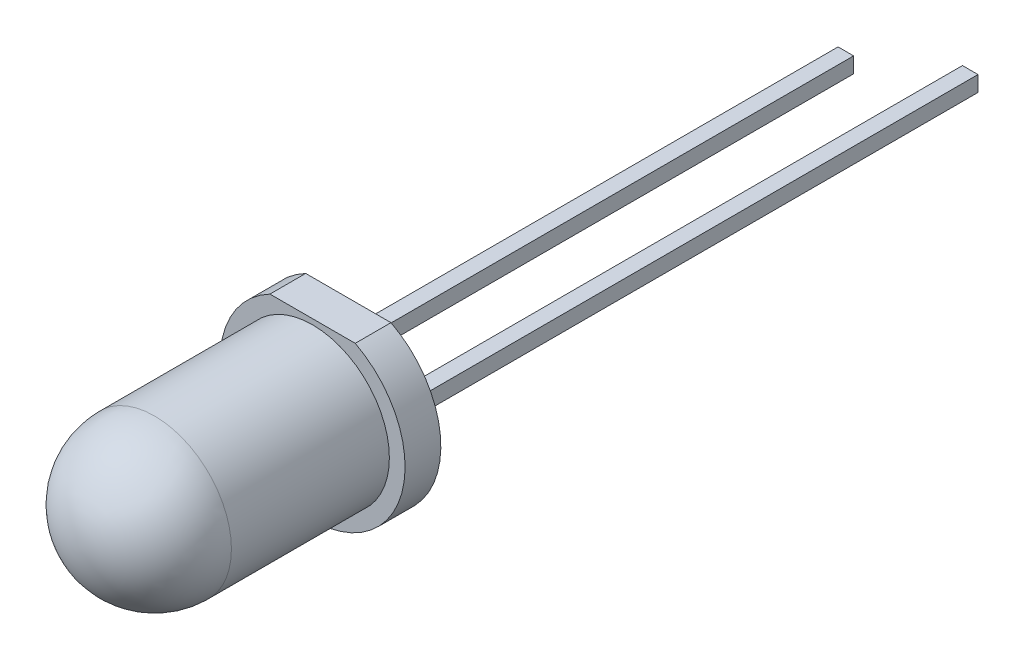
ISO-10303-21;
HEADER;
FILE_DESCRIPTION(('STEP AP214'),'2;1');
FILE_NAME('part.step','',(''),(''),'','','');
FILE_SCHEMA(('AUTOMOTIVE_DESIGN { 1 0 10303 214 1 1 1 1 }'));
ENDSEC;
DATA;
#1=APPLICATION_CONTEXT('core data for automotive mechanical design processes');
#2=APPLICATION_PROTOCOL_DEFINITION('international standard','automotive_design',2000,#1);
#3=PRODUCT_CONTEXT('',#1,'mechanical');
#4=PRODUCT('Part','Part','',(#3));
#5=PRODUCT_RELATED_PRODUCT_CATEGORY('part','',(#4));
#6=PRODUCT_DEFINITION_FORMATION('','',#4);
#7=PRODUCT_DEFINITION_CONTEXT('part definition',#1,'design');
#8=PRODUCT_DEFINITION('design','',#6,#7);
#9=PRODUCT_DEFINITION_SHAPE('','',#8);
#10=(LENGTH_UNIT() NAMED_UNIT(*) SI_UNIT(.MILLI.,.METRE.));
#11=(NAMED_UNIT(*) PLANE_ANGLE_UNIT() SI_UNIT($,.RADIAN.));
#12=(NAMED_UNIT(*) SI_UNIT($,.STERADIAN.) SOLID_ANGLE_UNIT());
#13=UNCERTAINTY_MEASURE_WITH_UNIT(LENGTH_MEASURE(1.E-05),#10,'distance_accuracy_value','');
#14=(GEOMETRIC_REPRESENTATION_CONTEXT(3) GLOBAL_UNCERTAINTY_ASSIGNED_CONTEXT((#13)) GLOBAL_UNIT_ASSIGNED_CONTEXT((#10,
#11,#12)) REPRESENTATION_CONTEXT('',''));
#15=CARTESIAN_POINT('',(0.,0.,0.));
#16=DIRECTION('',(0.,0.,1.));
#17=DIRECTION('',(1.,0.,0.));
#18=AXIS2_PLACEMENT_3D('',#15,#16,#17);
#19=CARTESIAN_POINT('',(0.25,1.51,-20.575));
#20=DIRECTION('',(-1.,0.,0.));
#21=DIRECTION('',(0.,-1.,0.));
#22=AXIS2_PLACEMENT_3D('',#19,#20,#21);
#23=PLANE('',#22);
#24=DIRECTION('',(0.,-1.,0.));
#25=VECTOR('',#24,1.);
#26=CARTESIAN_POINT('',(0.25,1.51,-16.575));
#27=LINE('',#26,#25);
#28=CARTESIAN_POINT('',(0.25,1.51,-16.575));
#29=VERTEX_POINT('',#28);
#30=CARTESIAN_POINT('',(0.25,1.01,-16.575));
#31=VERTEX_POINT('',#30);
#32=EDGE_CURVE('E105',#29,#31,#27,.T.);
#33=ORIENTED_EDGE('',*,*,#32,.F.);
#34=DIRECTION('',(0.,0.,1.));
#35=VECTOR('',#34,1.);
#36=CARTESIAN_POINT('',(0.25,1.51,-20.575));
#37=LINE('',#36,#35);
#38=CARTESIAN_POINT('',(0.25,1.51,-0.575));
#39=VERTEX_POINT('',#38);
#40=EDGE_CURVE('E233',#29,#39,#37,.T.);
#41=ORIENTED_EDGE('',*,*,#40,.T.);
#42=DIRECTION('',(0.,-1.,0.));
#43=VECTOR('',#42,1.);
#44=CARTESIAN_POINT('',(0.25,1.51,-0.575));
#45=LINE('',#44,#43);
#46=CARTESIAN_POINT('',(0.25,1.01,-0.575));
#47=VERTEX_POINT('',#46);
#48=EDGE_CURVE('E124',#39,#47,#45,.T.);
#49=ORIENTED_EDGE('',*,*,#48,.T.);
#50=DIRECTION('',(0.,0.,1.));
#51=VECTOR('',#50,1.);
#52=CARTESIAN_POINT('',(0.25,1.01,-20.575));
#53=LINE('',#52,#51);
#54=EDGE_CURVE('E118',#31,#47,#53,.T.);
#55=ORIENTED_EDGE('',*,*,#54,.F.);
#56=EDGE_LOOP('',(#33,#41,#49,#55));
#57=FACE_BOUND('',#56,.T.);
#58=ADVANCED_FACE('F31',(#57),#23,.F.);
#59=CARTESIAN_POINT('',(0.25,1.01,-20.575));
#60=DIRECTION('',(0.,1.,0.));
#61=DIRECTION('',(0.,0.,1.));
#62=AXIS2_PLACEMENT_3D('',#59,#60,#61);
#63=PLANE('',#62);
#64=DIRECTION('',(-1.,0.,0.));
#65=VECTOR('',#64,1.);
#66=CARTESIAN_POINT('',(0.25,1.01,-16.575));
#67=LINE('',#66,#65);
#68=CARTESIAN_POINT('',(-0.25,1.01,-16.575));
#69=VERTEX_POINT('',#68);
#70=EDGE_CURVE('E108',#31,#69,#67,.T.);
#71=ORIENTED_EDGE('',*,*,#70,.F.);
#72=ORIENTED_EDGE('',*,*,#54,.T.);
#73=DIRECTION('',(-1.,0.,0.));
#74=VECTOR('',#73,1.);
#75=CARTESIAN_POINT('',(0.25,1.01,-0.575));
#76=LINE('',#75,#74);
#77=CARTESIAN_POINT('',(-0.25,1.01,-0.575));
#78=VERTEX_POINT('',#77);
#79=EDGE_CURVE('E225',#47,#78,#76,.T.);
#80=ORIENTED_EDGE('',*,*,#79,.T.);
#81=DIRECTION('',(0.,0.,1.));
#82=VECTOR('',#81,1.);
#83=CARTESIAN_POINT('',(-0.25,1.01,-20.575));
#84=LINE('',#83,#82);
#85=EDGE_CURVE('E120',#69,#78,#84,.T.);
#86=ORIENTED_EDGE('',*,*,#85,.F.);
#87=EDGE_LOOP('',(#71,#72,#80,#86));
#88=FACE_BOUND('',#87,.T.);
#89=ADVANCED_FACE('F116',(#88),#63,.F.);
#90=CARTESIAN_POINT('',(-0.25,1.51,-20.575));
#91=DIRECTION('',(1.,0.,0.));
#92=DIRECTION('',(0.,1.,0.));
#93=AXIS2_PLACEMENT_3D('',#90,#91,#92);
#94=PLANE('',#93);
#95=DIRECTION('',(0.,1.,0.));
#96=VECTOR('',#95,1.);
#97=CARTESIAN_POINT('',(-0.25,1.51,-16.575));
#98=LINE('',#97,#96);
#99=CARTESIAN_POINT('',(-0.25,1.51,-16.575));
#100=VERTEX_POINT('',#99);
#101=EDGE_CURVE('E46',#69,#100,#98,.T.);
#102=ORIENTED_EDGE('',*,*,#101,.F.);
#103=ORIENTED_EDGE('',*,*,#85,.T.);
#104=DIRECTION('',(0.,1.,0.));
#105=VECTOR('',#104,1.);
#106=CARTESIAN_POINT('',(-0.25,1.51,-0.575));
#107=LINE('',#106,#105);
#108=CARTESIAN_POINT('',(-0.25,1.51,-0.575));
#109=VERTEX_POINT('',#108);
#110=EDGE_CURVE('E227',#78,#109,#107,.T.);
#111=ORIENTED_EDGE('',*,*,#110,.T.);
#112=DIRECTION('',(0.,0.,1.));
#113=VECTOR('',#112,1.);
#114=CARTESIAN_POINT('',(-0.25,1.51,-20.575));
#115=LINE('',#114,#113);
#116=EDGE_CURVE('E129',#100,#109,#115,.T.);
#117=ORIENTED_EDGE('',*,*,#116,.F.);
#118=EDGE_LOOP('',(#102,#103,#111,#117));
#119=FACE_BOUND('',#118,.T.);
#120=ADVANCED_FACE('F167',(#119),#94,.F.);
#121=CARTESIAN_POINT('',(0.25,1.51,-20.575));
#122=DIRECTION('',(0.,-1.,0.));
#123=DIRECTION('',(0.,0.,-1.));
#124=AXIS2_PLACEMENT_3D('',#121,#122,#123);
#125=PLANE('',#124);
#126=DIRECTION('',(1.,0.,0.));
#127=VECTOR('',#126,1.);
#128=CARTESIAN_POINT('',(0.25,1.51,-16.575));
#129=LINE('',#128,#127);
#130=EDGE_CURVE('E109',#100,#29,#129,.T.);
#131=ORIENTED_EDGE('',*,*,#130,.F.);
#132=ORIENTED_EDGE('',*,*,#116,.T.);
#133=DIRECTION('',(1.,0.,0.));
#134=VECTOR('',#133,1.);
#135=CARTESIAN_POINT('',(0.25,1.51,-0.575));
#136=LINE('',#135,#134);
#137=EDGE_CURVE('E230',#109,#39,#136,.T.);
#138=ORIENTED_EDGE('',*,*,#137,.T.);
#139=ORIENTED_EDGE('',*,*,#40,.F.);
#140=EDGE_LOOP('',(#131,#132,#138,#139));
#141=FACE_BOUND('',#140,.T.);
#142=ADVANCED_FACE('F177',(#141),#125,.F.);
#143=CARTESIAN_POINT('',(0.,0.,-0.575));
#144=DIRECTION('',(0.,0.,1.));
#145=DIRECTION('',(1.,0.,0.));
#146=AXIS2_PLACEMENT_3D('',#143,#144,#145);
#147=PLANE('',#146);
#148=ORIENTED_EDGE('',*,*,#48,.F.);
#149=ORIENTED_EDGE('',*,*,#137,.F.);
#150=ORIENTED_EDGE('',*,*,#110,.F.);
#151=ORIENTED_EDGE('',*,*,#79,.F.);
#152=EDGE_LOOP('',(#148,#149,#150,#151));
#153=FACE_BOUND('',#152,.T.);
#154=DIRECTION('',(-1.,0.,0.));
#155=VECTOR('',#154,1.);
#156=CARTESIAN_POINT('',(0.,2.64,-0.575));
#157=LINE('',#156,#155);
#158=CARTESIAN_POINT('',(1.37150464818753,2.64,-0.575));
#159=VERTEX_POINT('',#158);
#160=CARTESIAN_POINT('',(-1.37150464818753,2.64,-0.575));
#161=VERTEX_POINT('',#160);
#162=EDGE_CURVE('E11',#159,#161,#157,.T.);
#163=ORIENTED_EDGE('',*,*,#162,.F.);
#164=CARTESIAN_POINT('',(0.,0.,-0.575));
#165=DIRECTION('',(0.,0.,1.));
#166=DIRECTION('',(1.,0.,0.));
#167=AXIS2_PLACEMENT_3D('',#164,#165,#166);
#168=CIRCLE('',#167,2.975);
#169=EDGE_CURVE('E140',#161,#159,#168,.T.);
#170=ORIENTED_EDGE('',*,*,#169,.F.);
#171=EDGE_LOOP('',(#163,#170));
#172=FACE_BOUND('',#171,.T.);
#173=DIRECTION('',(0.,-1.,0.));
#174=VECTOR('',#173,1.);
#175=CARTESIAN_POINT('',(0.25,-1.01,-0.575));
#176=LINE('',#175,#174);
#177=CARTESIAN_POINT('',(0.25,-1.01,-0.575));
#178=VERTEX_POINT('',#177);
#179=CARTESIAN_POINT('',(0.25,-1.51,-0.575));
#180=VERTEX_POINT('',#179);
#181=EDGE_CURVE('E191',#178,#180,#176,.T.);
#182=ORIENTED_EDGE('',*,*,#181,.F.);
#183=DIRECTION('',(1.,0.,0.));
#184=VECTOR('',#183,1.);
#185=CARTESIAN_POINT('',(0.25,-1.01,-0.575));
#186=LINE('',#185,#184);
#187=CARTESIAN_POINT('',(-0.25,-1.01,-0.575));
#188=VERTEX_POINT('',#187);
#189=EDGE_CURVE('E193',#188,#178,#186,.T.);
#190=ORIENTED_EDGE('',*,*,#189,.F.);
#191=DIRECTION('',(0.,1.,0.));
#192=VECTOR('',#191,1.);
#193=CARTESIAN_POINT('',(-0.25,-1.01,-0.575));
#194=LINE('',#193,#192);
#195=CARTESIAN_POINT('',(-0.25,-1.51,-0.575));
#196=VERTEX_POINT('',#195);
#197=EDGE_CURVE('E209',#196,#188,#194,.T.);
#198=ORIENTED_EDGE('',*,*,#197,.F.);
#199=DIRECTION('',(-1.,0.,0.));
#200=VECTOR('',#199,1.);
#201=CARTESIAN_POINT('',(0.25,-1.51,-0.575));
#202=LINE('',#201,#200);
#203=EDGE_CURVE('E54',#180,#196,#202,.T.);
#204=ORIENTED_EDGE('',*,*,#203,.F.);
#205=EDGE_LOOP('',(#182,#190,#198,#204));
#206=FACE_BOUND('',#205,.T.);
#207=ADVANCED_FACE('F174',(#153,#172,#206),#147,.F.);
#208=CARTESIAN_POINT('',(0.,0.,0.575));
#209=DIRECTION('',(0.,0.,1.));
#210=DIRECTION('',(1.,0.,0.));
#211=AXIS2_PLACEMENT_3D('',#208,#209,#210);
#212=PLANE('',#211);
#213=CARTESIAN_POINT('',(0.,0.,0.575));
#214=DIRECTION('',(0.,0.,1.));
#215=DIRECTION('',(1.,0.,0.));
#216=AXIS2_PLACEMENT_3D('',#213,#214,#215);
#217=CIRCLE('',#216,2.47);
#218=CARTESIAN_POINT('',(2.47,0.,0.575));
#219=VERTEX_POINT('',#218);
#220=EDGE_CURVE('E137',#219,#219,#217,.T.);
#221=ORIENTED_EDGE('',*,*,#220,.F.);
#222=EDGE_LOOP('',(#221));
#223=FACE_BOUND('',#222,.T.);
#224=CARTESIAN_POINT('',(0.,0.,0.575));
#225=DIRECTION('',(0.,0.,1.));
#226=DIRECTION('',(1.,0.,0.));
#227=AXIS2_PLACEMENT_3D('',#224,#225,#226);
#228=CIRCLE('',#227,2.975);
#229=CARTESIAN_POINT('',(-1.37150464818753,2.64,0.575));
#230=VERTEX_POINT('',#229);
#231=CARTESIAN_POINT('',(1.37150464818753,2.64,0.575));
#232=VERTEX_POINT('',#231);
#233=EDGE_CURVE('E141',#230,#232,#228,.T.);
#234=ORIENTED_EDGE('',*,*,#233,.T.);
#235=DIRECTION('',(-1.,0.,0.));
#236=VECTOR('',#235,1.);
#237=CARTESIAN_POINT('',(0.,2.64,0.575));
#238=LINE('',#237,#236);
#239=EDGE_CURVE('E134',#232,#230,#238,.T.);
#240=ORIENTED_EDGE('',*,*,#239,.T.);
#241=EDGE_LOOP('',(#234,#240));
#242=FACE_BOUND('',#241,.T.);
#243=ADVANCED_FACE('F171',(#223,#242),#212,.T.);
#244=CARTESIAN_POINT('',(0.,0.,0.575));
#245=DIRECTION('',(0.,0.,-1.));
#246=DIRECTION('',(-1.,0.,0.));
#247=AXIS2_PLACEMENT_3D('',#244,#245,#246);
#248=CYLINDRICAL_SURFACE('',#247,2.975);
#249=DIRECTION('',(0.,0.,-1.));
#250=VECTOR('',#249,1.);
#251=CARTESIAN_POINT('',(1.37150464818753,2.64,0.575));
#252=LINE('',#251,#250);
#253=EDGE_CURVE('E127',#232,#159,#252,.T.);
#254=ORIENTED_EDGE('',*,*,#253,.F.);
#255=ORIENTED_EDGE('',*,*,#233,.F.);
#256=DIRECTION('',(0.,0.,-1.));
#257=VECTOR('',#256,1.);
#258=CARTESIAN_POINT('',(-1.37150464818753,2.64,0.575));
#259=LINE('',#258,#257);
#260=EDGE_CURVE('E125',#161,#230,#259,.F.);
#261=ORIENTED_EDGE('',*,*,#260,.F.);
#262=ORIENTED_EDGE('',*,*,#169,.T.);
#263=EDGE_LOOP('',(#254,#255,#261,#262));
#264=FACE_BOUND('',#263,.T.);
#265=ADVANCED_FACE('F160',(#264),#248,.T.);
#266=CARTESIAN_POINT('',(0.,0.,8.125));
#267=DIRECTION('',(0.,0.,-1.));
#268=DIRECTION('',(-1.,0.,0.));
#269=AXIS2_PLACEMENT_3D('',#266,#267,#268);
#270=CYLINDRICAL_SURFACE('',#269,2.47);
#271=CARTESIAN_POINT('',(0.,0.,5.655));
#272=DIRECTION('',(0.,0.,-1.));
#273=DIRECTION('',(-1.,0.,0.));
#274=AXIS2_PLACEMENT_3D('',#271,#272,#273);
#275=CIRCLE('',#274,2.47);
#276=CARTESIAN_POINT('',(-2.47,0.,5.655));
#277=VERTEX_POINT('',#276);
#278=EDGE_CURVE('E39',#277,#277,#275,.T.);
#279=ORIENTED_EDGE('',*,*,#278,.T.);
#280=EDGE_LOOP('',(#279));
#281=FACE_BOUND('',#280,.T.);
#282=ORIENTED_EDGE('',*,*,#220,.T.);
#283=EDGE_LOOP('',(#282));
#284=FACE_BOUND('',#283,.T.);
#285=ADVANCED_FACE('F148',(#281,#284),#270,.T.);
#286=CARTESIAN_POINT('',(0.,0.,5.655));
#287=DIRECTION('',(0.,0.,1.));
#288=DIRECTION('',(1.,0.,0.));
#289=AXIS2_PLACEMENT_3D('',#286,#287,#288);
#290=SPHERICAL_SURFACE('',#289,2.47);
#291=ORIENTED_EDGE('',*,*,#278,.F.);
#292=EDGE_LOOP('',(#291));
#293=FACE_BOUND('',#292,.T.);
#294=ADVANCED_FACE('F33',(#293),#290,.T.);
#295=CARTESIAN_POINT('',(-4.59893373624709,2.64,3.07803442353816));
#296=DIRECTION('',(0.,1.,0.));
#297=DIRECTION('',(0.,0.,1.));
#298=AXIS2_PLACEMENT_3D('',#295,#296,#297);
#299=PLANE('',#298);
#300=ORIENTED_EDGE('',*,*,#253,.T.);
#301=ORIENTED_EDGE('',*,*,#162,.T.);
#302=ORIENTED_EDGE('',*,*,#260,.T.);
#303=ORIENTED_EDGE('',*,*,#239,.F.);
#304=EDGE_LOOP('',(#300,#301,#302,#303));
#305=FACE_BOUND('',#304,.T.);
#306=ADVANCED_FACE('F152',(#305),#299,.T.);
#307=CARTESIAN_POINT('',(0.25,-1.01,-20.575));
#308=DIRECTION('',(-1.,0.,0.));
#309=DIRECTION('',(0.,-1.,0.));
#310=AXIS2_PLACEMENT_3D('',#307,#308,#309);
#311=PLANE('',#310);
#312=ORIENTED_EDGE('',*,*,#181,.T.);
#313=DIRECTION('',(0.,0.,1.));
#314=VECTOR('',#313,1.);
#315=CARTESIAN_POINT('',(0.25,-1.51,-20.575));
#316=LINE('',#315,#314);
#317=CARTESIAN_POINT('',(0.25,-1.51,-20.575));
#318=VERTEX_POINT('',#317);
#319=EDGE_CURVE('E222',#318,#180,#316,.T.);
#320=ORIENTED_EDGE('',*,*,#319,.F.);
#321=DIRECTION('',(0.,-1.,0.));
#322=VECTOR('',#321,1.);
#323=CARTESIAN_POINT('',(0.25,-1.01,-20.575));
#324=LINE('',#323,#322);
#325=CARTESIAN_POINT('',(0.25,-1.01,-20.575));
#326=VERTEX_POINT('',#325);
#327=EDGE_CURVE('E208',#326,#318,#324,.T.);
#328=ORIENTED_EDGE('',*,*,#327,.F.);
#329=DIRECTION('',(0.,0.,1.));
#330=VECTOR('',#329,1.);
#331=CARTESIAN_POINT('',(0.25,-1.01,-20.575));
#332=LINE('',#331,#330);
#333=EDGE_CURVE('E204',#326,#178,#332,.T.);
#334=ORIENTED_EDGE('',*,*,#333,.T.);
#335=EDGE_LOOP('',(#312,#320,#328,#334));
#336=FACE_BOUND('',#335,.T.);
#337=ADVANCED_FACE('F157',(#336),#311,.F.);
#338=CARTESIAN_POINT('',(0.25,-1.51,-20.575));
#339=DIRECTION('',(0.,1.,0.));
#340=DIRECTION('',(0.,0.,1.));
#341=AXIS2_PLACEMENT_3D('',#338,#339,#340);
#342=PLANE('',#341);
#343=ORIENTED_EDGE('',*,*,#203,.T.);
#344=DIRECTION('',(0.,0.,1.));
#345=VECTOR('',#344,1.);
#346=CARTESIAN_POINT('',(-0.25,-1.51,-20.575));
#347=LINE('',#346,#345);
#348=CARTESIAN_POINT('',(-0.25,-1.51,-20.575));
#349=VERTEX_POINT('',#348);
#350=EDGE_CURVE('E214',#349,#196,#347,.T.);
#351=ORIENTED_EDGE('',*,*,#350,.F.);
#352=DIRECTION('',(-1.,0.,0.));
#353=VECTOR('',#352,1.);
#354=CARTESIAN_POINT('',(0.25,-1.51,-20.575));
#355=LINE('',#354,#353);
#356=EDGE_CURVE('E243',#318,#349,#355,.T.);
#357=ORIENTED_EDGE('',*,*,#356,.F.);
#358=ORIENTED_EDGE('',*,*,#319,.T.);
#359=EDGE_LOOP('',(#343,#351,#357,#358));
#360=FACE_BOUND('',#359,.T.);
#361=ADVANCED_FACE('F251',(#360),#342,.F.);
#362=CARTESIAN_POINT('',(-0.25,-1.01,-20.575));
#363=DIRECTION('',(1.,0.,0.));
#364=DIRECTION('',(0.,1.,0.));
#365=AXIS2_PLACEMENT_3D('',#362,#363,#364);
#366=PLANE('',#365);
#367=ORIENTED_EDGE('',*,*,#197,.T.);
#368=DIRECTION('',(0.,0.,1.));
#369=VECTOR('',#368,1.);
#370=CARTESIAN_POINT('',(-0.25,-1.01,-20.575));
#371=LINE('',#370,#369);
#372=CARTESIAN_POINT('',(-0.25,-1.01,-20.575));
#373=VERTEX_POINT('',#372);
#374=EDGE_CURVE('E207',#373,#188,#371,.T.);
#375=ORIENTED_EDGE('',*,*,#374,.F.);
#376=DIRECTION('',(0.,1.,0.));
#377=VECTOR('',#376,1.);
#378=CARTESIAN_POINT('',(-0.25,-1.01,-20.575));
#379=LINE('',#378,#377);
#380=EDGE_CURVE('E216',#349,#373,#379,.T.);
#381=ORIENTED_EDGE('',*,*,#380,.F.);
#382=ORIENTED_EDGE('',*,*,#350,.T.);
#383=EDGE_LOOP('',(#367,#375,#381,#382));
#384=FACE_BOUND('',#383,.T.);
#385=ADVANCED_FACE('F247',(#384),#366,.F.);
#386=CARTESIAN_POINT('',(0.25,-1.01,-20.575));
#387=DIRECTION('',(0.,-1.,0.));
#388=DIRECTION('',(1.,0.,0.));
#389=AXIS2_PLACEMENT_3D('',#386,#387,#388);
#390=PLANE('',#389);
#391=ORIENTED_EDGE('',*,*,#189,.T.);
#392=ORIENTED_EDGE('',*,*,#333,.F.);
#393=DIRECTION('',(1.,0.,0.));
#394=VECTOR('',#393,1.);
#395=CARTESIAN_POINT('',(0.25,-1.01,-20.575));
#396=LINE('',#395,#394);
#397=EDGE_CURVE('E212',#373,#326,#396,.T.);
#398=ORIENTED_EDGE('',*,*,#397,.F.);
#399=ORIENTED_EDGE('',*,*,#374,.T.);
#400=EDGE_LOOP('',(#391,#392,#398,#399));
#401=FACE_BOUND('',#400,.T.);
#402=ADVANCED_FACE('F202',(#401),#390,.F.);
#403=CARTESIAN_POINT('',(0.25,-1.51,-20.575));
#404=DIRECTION('',(0.,0.,-1.));
#405=DIRECTION('',(-1.,0.,0.));
#406=AXIS2_PLACEMENT_3D('',#403,#404,#405);
#407=PLANE('',#406);
#408=ORIENTED_EDGE('',*,*,#327,.T.);
#409=ORIENTED_EDGE('',*,*,#356,.T.);
#410=ORIENTED_EDGE('',*,*,#380,.T.);
#411=ORIENTED_EDGE('',*,*,#397,.T.);
#412=EDGE_LOOP('',(#408,#409,#410,#411));
#413=FACE_BOUND('',#412,.T.);
#414=ADVANCED_FACE('F253',(#413),#407,.T.);
#415=CARTESIAN_POINT('',(0.25,1.01,-16.575));
#416=DIRECTION('',(0.,0.,-1.));
#417=DIRECTION('',(-1.,0.,0.));
#418=AXIS2_PLACEMENT_3D('',#415,#416,#417);
#419=PLANE('',#418);
#420=ORIENTED_EDGE('',*,*,#32,.T.);
#421=ORIENTED_EDGE('',*,*,#70,.T.);
#422=ORIENTED_EDGE('',*,*,#101,.T.);
#423=ORIENTED_EDGE('',*,*,#130,.T.);
#424=EDGE_LOOP('',(#420,#421,#422,#423));
#425=FACE_BOUND('',#424,.T.);
#426=ADVANCED_FACE('F107',(#425),#419,.T.);
#427=CLOSED_SHELL('',(#58,#89,#120,#142,#207,#243,#265,#285,#294,#306,#337,#361,#385,#402,#414,#426));
#428=MANIFOLD_SOLID_BREP('B2',#427);
#429=ADVANCED_BREP_SHAPE_REPRESENTATION('',(#18,#428),#14);
#430=SHAPE_DEFINITION_REPRESENTATION(#9,#429);
ENDSEC;
END-ISO-10303-21;
